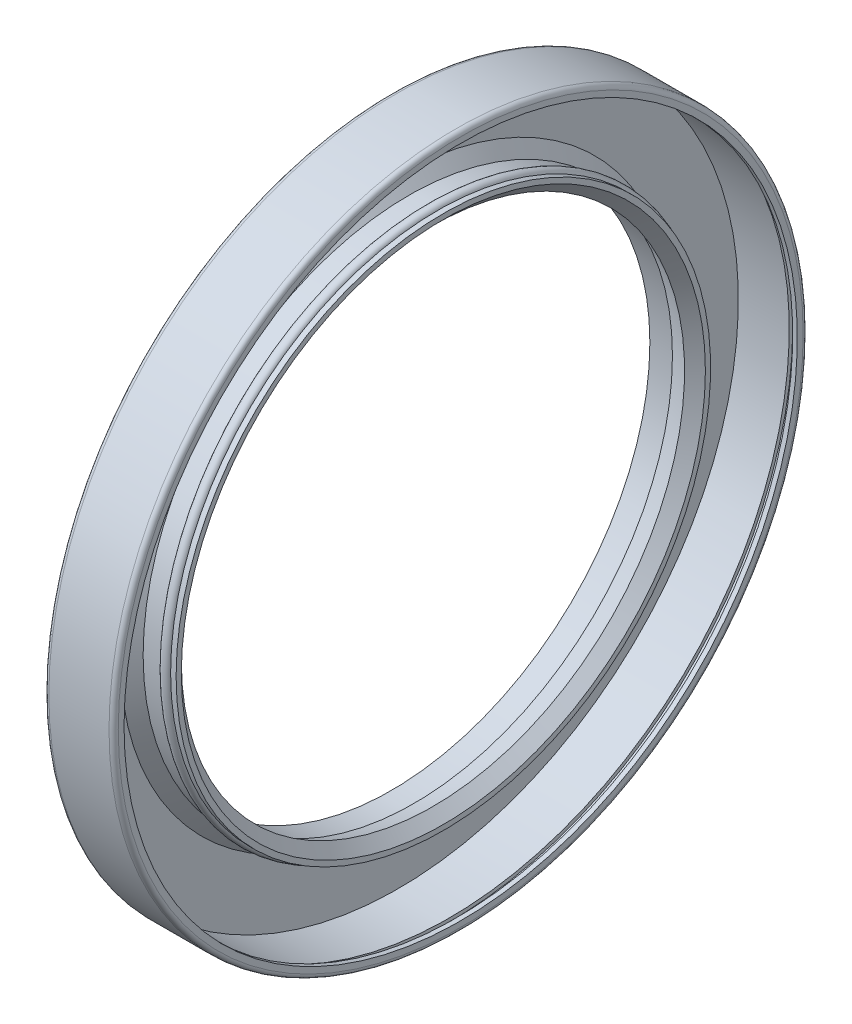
ISO-10303-21;
HEADER;
FILE_DESCRIPTION(('STEP AP214'),'2;1');
FILE_NAME('part.step','',(''),(''),'','','');
FILE_SCHEMA(('AUTOMOTIVE_DESIGN { 1 0 10303 214 1 1 1 1 }'));
ENDSEC;
DATA;
#1=APPLICATION_CONTEXT('core data for automotive mechanical design processes');
#2=APPLICATION_PROTOCOL_DEFINITION('international standard','automotive_design',2000,#1);
#3=PRODUCT_CONTEXT('',#1,'mechanical');
#4=PRODUCT('Part','Part','',(#3));
#5=PRODUCT_RELATED_PRODUCT_CATEGORY('part','',(#4));
#6=PRODUCT_DEFINITION_FORMATION('','',#4);
#7=PRODUCT_DEFINITION_CONTEXT('part definition',#1,'design');
#8=PRODUCT_DEFINITION('design','',#6,#7);
#9=PRODUCT_DEFINITION_SHAPE('','',#8);
#10=(LENGTH_UNIT() NAMED_UNIT(*) SI_UNIT(.MILLI.,.METRE.));
#11=(NAMED_UNIT(*) PLANE_ANGLE_UNIT() SI_UNIT($,.RADIAN.));
#12=(NAMED_UNIT(*) SI_UNIT($,.STERADIAN.) SOLID_ANGLE_UNIT());
#13=UNCERTAINTY_MEASURE_WITH_UNIT(LENGTH_MEASURE(1.E-05),#10,'distance_accuracy_value','');
#14=(GEOMETRIC_REPRESENTATION_CONTEXT(3) GLOBAL_UNCERTAINTY_ASSIGNED_CONTEXT((#13)) GLOBAL_UNIT_ASSIGNED_CONTEXT((#10,
#11,#12)) REPRESENTATION_CONTEXT('',''));
#15=CARTESIAN_POINT('',(0.,0.,0.));
#16=DIRECTION('',(0.,0.,1.));
#17=DIRECTION('',(1.,0.,0.));
#18=AXIS2_PLACEMENT_3D('',#15,#16,#17);
#19=CARTESIAN_POINT('',(0.,0.,-29.8));
#20=DIRECTION('',(1.,0.,0.));
#21=DIRECTION('',(0.,0.,-1.));
#22=AXIS2_PLACEMENT_3D('',#19,#20,#21);
#23=PLANE('',#22);
#24=CARTESIAN_POINT('',(0.,0.,0.));
#25=DIRECTION('',(-1.,0.,0.));
#26=DIRECTION('',(0.,0.,1.));
#27=AXIS2_PLACEMENT_3D('',#24,#25,#26);
#28=CIRCLE('',#27,39.4666666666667);
#29=CARTESIAN_POINT('',(0.,0.,39.4666666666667));
#30=VERTEX_POINT('',#29);
#31=EDGE_CURVE('E69',#30,#30,#28,.T.);
#32=ORIENTED_EDGE('',*,*,#31,.T.);
#33=EDGE_LOOP('',(#32));
#34=FACE_BOUND('',#33,.T.);
#35=CARTESIAN_POINT('',(0.,0.,0.));
#36=DIRECTION('',(1.,0.,0.));
#37=DIRECTION('',(0.,0.,-1.));
#38=AXIS2_PLACEMENT_3D('',#35,#36,#37);
#39=CIRCLE('',#38,30.2);
#40=CARTESIAN_POINT('',(0.,0.,-30.2));
#41=VERTEX_POINT('',#40);
#42=EDGE_CURVE('E10',#41,#41,#39,.F.);
#43=ORIENTED_EDGE('',*,*,#42,.F.);
#44=EDGE_LOOP('',(#43));
#45=FACE_BOUND('',#44,.T.);
#46=ADVANCED_FACE('F31',(#34,#45),#23,.F.);
#47=CARTESIAN_POINT('',(0.,0.,0.));
#48=DIRECTION('',(-1.,0.,0.));
#49=DIRECTION('',(0.,0.,1.));
#50=AXIS2_PLACEMENT_3D('',#47,#48,#49);
#51=CYLINDRICAL_SURFACE('',#50,39.2);
#52=CARTESIAN_POINT('',(6.66666666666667,0.,0.));
#53=DIRECTION('',(-1.,0.,0.));
#54=DIRECTION('',(0.,0.,1.));
#55=AXIS2_PLACEMENT_3D('',#52,#53,#54);
#56=CIRCLE('',#55,39.2);
#57=CARTESIAN_POINT('',(6.66666666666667,0.,39.2));
#58=VERTEX_POINT('',#57);
#59=EDGE_CURVE('E39',#58,#58,#56,.T.);
#60=ORIENTED_EDGE('',*,*,#59,.F.);
#61=EDGE_LOOP('',(#60));
#62=FACE_BOUND('',#61,.T.);
#63=CARTESIAN_POINT('',(0.8,0.,0.));
#64=DIRECTION('',(-1.,0.,0.));
#65=DIRECTION('',(0.,0.,1.));
#66=AXIS2_PLACEMENT_3D('',#63,#64,#65);
#67=CIRCLE('',#66,39.2);
#68=CARTESIAN_POINT('',(0.8,0.,39.2));
#69=VERTEX_POINT('',#68);
#70=EDGE_CURVE('E99',#69,#69,#67,.T.);
#71=ORIENTED_EDGE('',*,*,#70,.T.);
#72=EDGE_LOOP('',(#71));
#73=FACE_BOUND('',#72,.T.);
#74=ADVANCED_FACE('F33',(#62,#73),#51,.F.);
#75=CARTESIAN_POINT('',(6.66666666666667,0.,-39.2));
#76=DIRECTION('',(-1.,0.,0.));
#77=DIRECTION('',(0.,0.,1.));
#78=AXIS2_PLACEMENT_3D('',#75,#76,#77);
#79=PLANE('',#78);
#80=CARTESIAN_POINT('',(6.66666666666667,0.,0.));
#81=DIRECTION('',(-1.,0.,0.));
#82=DIRECTION('',(0.,0.,1.));
#83=AXIS2_PLACEMENT_3D('',#80,#81,#82);
#84=CIRCLE('',#83,39.6);
#85=CARTESIAN_POINT('',(6.66666666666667,0.,39.6));
#86=VERTEX_POINT('',#85);
#87=EDGE_CURVE('E45',#86,#86,#84,.T.);
#88=ORIENTED_EDGE('',*,*,#87,.F.);
#89=EDGE_LOOP('',(#88));
#90=FACE_BOUND('',#89,.T.);
#91=ORIENTED_EDGE('',*,*,#59,.T.);
#92=EDGE_LOOP('',(#91));
#93=FACE_BOUND('',#92,.T.);
#94=ADVANCED_FACE('F173',(#90,#93),#79,.F.);
#95=CARTESIAN_POINT('',(0.,0.,0.));
#96=DIRECTION('',(-1.,0.,0.));
#97=DIRECTION('',(0.,0.,1.));
#98=AXIS2_PLACEMENT_3D('',#95,#96,#97);
#99=CYLINDRICAL_SURFACE('',#98,39.6);
#100=CARTESIAN_POINT('',(7.46666666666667,0.,0.));
#101=DIRECTION('',(-1.,0.,0.));
#102=DIRECTION('',(0.,0.,1.));
#103=AXIS2_PLACEMENT_3D('',#100,#101,#102);
#104=CIRCLE('',#103,39.6);
#105=CARTESIAN_POINT('',(7.46666666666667,0.,39.6));
#106=VERTEX_POINT('',#105);
#107=EDGE_CURVE('E49',#106,#106,#104,.T.);
#108=ORIENTED_EDGE('',*,*,#107,.F.);
#109=EDGE_LOOP('',(#108));
#110=FACE_BOUND('',#109,.T.);
#111=ORIENTED_EDGE('',*,*,#87,.T.);
#112=EDGE_LOOP('',(#111));
#113=FACE_BOUND('',#112,.T.);
#114=ADVANCED_FACE('F206',(#110,#113),#99,.F.);
#115=CARTESIAN_POINT('',(7.46666666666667,0.,-39.6));
#116=DIRECTION('',(1.,0.,0.));
#117=DIRECTION('',(0.,0.,-1.));
#118=AXIS2_PLACEMENT_3D('',#115,#116,#117);
#119=PLANE('',#118);
#120=CARTESIAN_POINT('',(7.46666666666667,0.,0.));
#121=DIRECTION('',(-1.,0.,0.));
#122=DIRECTION('',(0.,0.,1.));
#123=AXIS2_PLACEMENT_3D('',#120,#121,#122);
#124=CIRCLE('',#123,38.8);
#125=CARTESIAN_POINT('',(7.46666666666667,0.,38.8));
#126=VERTEX_POINT('',#125);
#127=EDGE_CURVE('E54',#126,#126,#124,.T.);
#128=ORIENTED_EDGE('',*,*,#127,.F.);
#129=EDGE_LOOP('',(#128));
#130=FACE_BOUND('',#129,.T.);
#131=ORIENTED_EDGE('',*,*,#107,.T.);
#132=EDGE_LOOP('',(#131));
#133=FACE_BOUND('',#132,.T.);
#134=ADVANCED_FACE('F200',(#130,#133),#119,.F.);
#135=CARTESIAN_POINT('',(0.,0.,0.));
#136=DIRECTION('',(-1.,0.,0.));
#137=DIRECTION('',(0.,0.,1.));
#138=AXIS2_PLACEMENT_3D('',#135,#136,#137);
#139=CYLINDRICAL_SURFACE('',#138,38.8);
#140=CARTESIAN_POINT('',(8.,0.,0.));
#141=DIRECTION('',(-1.,0.,0.));
#142=DIRECTION('',(0.,0.,1.));
#143=AXIS2_PLACEMENT_3D('',#140,#141,#142);
#144=CIRCLE('',#143,38.8);
#145=CARTESIAN_POINT('',(8.,0.,38.8));
#146=VERTEX_POINT('',#145);
#147=EDGE_CURVE('E57',#146,#146,#144,.T.);
#148=ORIENTED_EDGE('',*,*,#147,.F.);
#149=EDGE_LOOP('',(#148));
#150=FACE_BOUND('',#149,.T.);
#151=ORIENTED_EDGE('',*,*,#127,.T.);
#152=EDGE_LOOP('',(#151));
#153=FACE_BOUND('',#152,.T.);
#154=ADVANCED_FACE('F194',(#150,#153),#139,.F.);
#155=CARTESIAN_POINT('',(8.,0.,-38.8));
#156=DIRECTION('',(-1.,0.,0.));
#157=DIRECTION('',(0.,0.,1.));
#158=AXIS2_PLACEMENT_3D('',#155,#156,#157);
#159=PLANE('',#158);
#160=CARTESIAN_POINT('',(8.,0.,0.));
#161=DIRECTION('',(-1.,0.,0.));
#162=DIRECTION('',(0.,0.,1.));
#163=AXIS2_PLACEMENT_3D('',#160,#161,#162);
#164=CIRCLE('',#163,39.4666666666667);
#165=CARTESIAN_POINT('',(8.,0.,39.4666666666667));
#166=VERTEX_POINT('',#165);
#167=EDGE_CURVE('E60',#166,#166,#164,.T.);
#168=ORIENTED_EDGE('',*,*,#167,.F.);
#169=EDGE_LOOP('',(#168));
#170=FACE_BOUND('',#169,.T.);
#171=ORIENTED_EDGE('',*,*,#147,.T.);
#172=EDGE_LOOP('',(#171));
#173=FACE_BOUND('',#172,.T.);
#174=ADVANCED_FACE('F188',(#170,#173),#159,.F.);
#175=CARTESIAN_POINT('',(7.46666666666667,0.,0.));
#176=DIRECTION('',(-1.,0.,0.));
#177=DIRECTION('',(0.,0.,1.));
#178=AXIS2_PLACEMENT_3D('',#175,#176,#177);
#179=TOROIDAL_SURFACE('',#178,39.4666666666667,0.533333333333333);
#180=CARTESIAN_POINT('',(7.46666666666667,0.,0.));
#181=DIRECTION('',(-1.,0.,0.));
#182=DIRECTION('',(0.,0.,1.));
#183=AXIS2_PLACEMENT_3D('',#180,#181,#182);
#184=CIRCLE('',#183,40.);
#185=CARTESIAN_POINT('',(7.46666666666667,0.,40.));
#186=VERTEX_POINT('',#185);
#187=EDGE_CURVE('E63',#186,#186,#184,.T.);
#188=ORIENTED_EDGE('',*,*,#187,.F.);
#189=EDGE_LOOP('',(#188));
#190=FACE_BOUND('',#189,.T.);
#191=ORIENTED_EDGE('',*,*,#167,.T.);
#192=EDGE_LOOP('',(#191));
#193=FACE_BOUND('',#192,.T.);
#194=ADVANCED_FACE('F182',(#190,#193),#179,.T.);
#195=CARTESIAN_POINT('',(0.,0.,0.));
#196=DIRECTION('',(-1.,0.,0.));
#197=DIRECTION('',(0.,0.,1.));
#198=AXIS2_PLACEMENT_3D('',#195,#196,#197);
#199=CYLINDRICAL_SURFACE('',#198,40.);
#200=CARTESIAN_POINT('',(0.533333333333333,0.,0.));
#201=DIRECTION('',(-1.,0.,0.));
#202=DIRECTION('',(0.,0.,1.));
#203=AXIS2_PLACEMENT_3D('',#200,#201,#202);
#204=CIRCLE('',#203,40.);
#205=CARTESIAN_POINT('',(0.533333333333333,0.,40.));
#206=VERTEX_POINT('',#205);
#207=EDGE_CURVE('E66',#206,#206,#204,.T.);
#208=ORIENTED_EDGE('',*,*,#207,.F.);
#209=EDGE_LOOP('',(#208));
#210=FACE_BOUND('',#209,.T.);
#211=ORIENTED_EDGE('',*,*,#187,.T.);
#212=EDGE_LOOP('',(#211));
#213=FACE_BOUND('',#212,.T.);
#214=ADVANCED_FACE('F165',(#210,#213),#199,.T.);
#215=CARTESIAN_POINT('',(0.533333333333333,0.,0.));
#216=DIRECTION('',(-1.,0.,0.));
#217=DIRECTION('',(0.,0.,1.));
#218=AXIS2_PLACEMENT_3D('',#215,#216,#217);
#219=TOROIDAL_SURFACE('',#218,39.4666666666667,0.533333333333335);
#220=ORIENTED_EDGE('',*,*,#31,.F.);
#221=EDGE_LOOP('',(#220));
#222=FACE_BOUND('',#221,.T.);
#223=ORIENTED_EDGE('',*,*,#207,.T.);
#224=EDGE_LOOP('',(#223));
#225=FACE_BOUND('',#224,.T.);
#226=ADVANCED_FACE('F160',(#222,#225),#219,.T.);
#227=ORIENTED_EDGE('',*,*,#42,.T.);
#228=EDGE_LOOP('',(#227));
#229=FACE_BOUND('',#228,.T.);
#230=CARTESIAN_POINT('',(0.,0.,0.));
#231=DIRECTION('',(-1.,0.,0.));
#232=DIRECTION('',(0.,0.,1.));
#233=AXIS2_PLACEMENT_3D('',#230,#231,#232);
#234=CIRCLE('',#233,29.8);
#235=CARTESIAN_POINT('',(0.,0.,29.8));
#236=VERTEX_POINT('',#235);
#237=EDGE_CURVE('E72',#236,#236,#234,.T.);
#238=ORIENTED_EDGE('',*,*,#237,.F.);
#239=EDGE_LOOP('',(#238));
#240=FACE_BOUND('',#239,.T.);
#241=ADVANCED_FACE('F155',(#229,#240),#23,.F.);
#242=CARTESIAN_POINT('',(0.,0.,0.));
#243=DIRECTION('',(-1.,0.,0.));
#244=DIRECTION('',(0.,0.,1.));
#245=AXIS2_PLACEMENT_3D('',#242,#243,#244);
#246=CYLINDRICAL_SURFACE('',#245,29.8);
#247=CARTESIAN_POINT('',(2.60201806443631,0.,0.));
#248=DIRECTION('',(-1.,0.,0.));
#249=DIRECTION('',(0.,0.,1.));
#250=AXIS2_PLACEMENT_3D('',#247,#248,#249);
#251=CIRCLE('',#250,29.8);
#252=CARTESIAN_POINT('',(2.60201806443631,0.,29.8));
#253=VERTEX_POINT('',#252);
#254=EDGE_CURVE('E75',#253,#253,#251,.T.);
#255=ORIENTED_EDGE('',*,*,#254,.F.);
#256=EDGE_LOOP('',(#255));
#257=FACE_BOUND('',#256,.T.);
#258=ORIENTED_EDGE('',*,*,#237,.T.);
#259=EDGE_LOOP('',(#258));
#260=FACE_BOUND('',#259,.T.);
#261=ADVANCED_FACE('F149',(#257,#260),#246,.F.);
#262=CARTESIAN_POINT('',(2.60201806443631,0.,0.));
#263=DIRECTION('',(-1.,0.,0.));
#264=DIRECTION('',(0.,0.,1.));
#265=AXIS2_PLACEMENT_3D('',#262,#263,#264);
#266=CONICAL_SURFACE('',#265,29.8,0.349065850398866);
#267=CARTESIAN_POINT('',(4.8,0.,0.));
#268=DIRECTION('',(-1.,0.,0.));
#269=DIRECTION('',(0.,0.,1.));
#270=AXIS2_PLACEMENT_3D('',#267,#268,#269);
#271=CIRCLE('',#270,29.);
#272=CARTESIAN_POINT('',(4.8,0.,29.));
#273=VERTEX_POINT('',#272);
#274=EDGE_CURVE('E78',#273,#273,#271,.T.);
#275=ORIENTED_EDGE('',*,*,#274,.F.);
#276=EDGE_LOOP('',(#275));
#277=FACE_BOUND('',#276,.T.);
#278=ORIENTED_EDGE('',*,*,#254,.T.);
#279=EDGE_LOOP('',(#278));
#280=FACE_BOUND('',#279,.T.);
#281=ADVANCED_FACE('F143',(#277,#280),#266,.F.);
#282=CARTESIAN_POINT('',(4.8,0.,0.));
#283=DIRECTION('',(1.,0.,0.));
#284=DIRECTION('',(0.,0.,-1.));
#285=AXIS2_PLACEMENT_3D('',#282,#283,#284);
#286=CONICAL_SURFACE('',#285,29.,0.785398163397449);
#287=CARTESIAN_POINT('',(6.,0.,0.));
#288=DIRECTION('',(-1.,0.,0.));
#289=DIRECTION('',(0.,0.,1.));
#290=AXIS2_PLACEMENT_3D('',#287,#288,#289);
#291=CIRCLE('',#290,30.2);
#292=CARTESIAN_POINT('',(6.,0.,30.2));
#293=VERTEX_POINT('',#292);
#294=EDGE_CURVE('E81',#293,#293,#291,.T.);
#295=ORIENTED_EDGE('',*,*,#294,.F.);
#296=EDGE_LOOP('',(#295));
#297=FACE_BOUND('',#296,.T.);
#298=ORIENTED_EDGE('',*,*,#274,.T.);
#299=EDGE_LOOP('',(#298));
#300=FACE_BOUND('',#299,.T.);
#301=ADVANCED_FACE('F137',(#297,#300),#286,.F.);
#302=CARTESIAN_POINT('',(6.,0.,-30.2));
#303=DIRECTION('',(-1.,0.,0.));
#304=DIRECTION('',(0.,0.,1.));
#305=AXIS2_PLACEMENT_3D('',#302,#303,#304);
#306=PLANE('',#305);
#307=CARTESIAN_POINT('',(6.,0.,0.));
#308=DIRECTION('',(-1.,0.,0.));
#309=DIRECTION('',(0.,0.,1.));
#310=AXIS2_PLACEMENT_3D('',#307,#308,#309);
#311=CIRCLE('',#310,30.8);
#312=CARTESIAN_POINT('',(6.,0.,30.8));
#313=VERTEX_POINT('',#312);
#314=EDGE_CURVE('E84',#313,#313,#311,.T.);
#315=ORIENTED_EDGE('',*,*,#314,.F.);
#316=EDGE_LOOP('',(#315));
#317=FACE_BOUND('',#316,.T.);
#318=ORIENTED_EDGE('',*,*,#294,.T.);
#319=EDGE_LOOP('',(#318));
#320=FACE_BOUND('',#319,.T.);
#321=ADVANCED_FACE('F131',(#317,#320),#306,.F.);
#322=CARTESIAN_POINT('',(0.,0.,0.));
#323=DIRECTION('',(-1.,0.,0.));
#324=DIRECTION('',(0.,0.,1.));
#325=AXIS2_PLACEMENT_3D('',#322,#323,#324);
#326=CYLINDRICAL_SURFACE('',#325,30.8);
#327=CARTESIAN_POINT('',(5.36568542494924,0.,0.));
#328=DIRECTION('',(-1.,0.,0.));
#329=DIRECTION('',(0.,0.,1.));
#330=AXIS2_PLACEMENT_3D('',#327,#328,#329);
#331=CIRCLE('',#330,30.8);
#332=CARTESIAN_POINT('',(5.36568542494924,0.,30.8));
#333=VERTEX_POINT('',#332);
#334=EDGE_CURVE('E87',#333,#333,#331,.T.);
#335=ORIENTED_EDGE('',*,*,#334,.F.);
#336=EDGE_LOOP('',(#335));
#337=FACE_BOUND('',#336,.T.);
#338=ORIENTED_EDGE('',*,*,#314,.T.);
#339=EDGE_LOOP('',(#338));
#340=FACE_BOUND('',#339,.T.);
#341=ADVANCED_FACE('F125',(#337,#340),#326,.T.);
#342=CARTESIAN_POINT('',(4.8,0.,0.));
#343=DIRECTION('',(-1.,0.,0.));
#344=DIRECTION('',(0.,0.,1.));
#345=AXIS2_PLACEMENT_3D('',#342,#343,#344);
#346=TOROIDAL_SURFACE('',#345,30.6,0.6);
#347=CARTESIAN_POINT('',(4.2,0.,0.));
#348=DIRECTION('',(-1.,0.,0.));
#349=DIRECTION('',(0.,0.,1.));
#350=AXIS2_PLACEMENT_3D('',#347,#348,#349);
#351=CIRCLE('',#350,30.6);
#352=CARTESIAN_POINT('',(4.2,0.,30.6));
#353=VERTEX_POINT('',#352);
#354=EDGE_CURVE('E90',#353,#353,#351,.T.);
#355=ORIENTED_EDGE('',*,*,#354,.F.);
#356=EDGE_LOOP('',(#355));
#357=FACE_BOUND('',#356,.T.);
#358=ORIENTED_EDGE('',*,*,#334,.T.);
#359=EDGE_LOOP('',(#358));
#360=FACE_BOUND('',#359,.T.);
#361=ADVANCED_FACE('F119',(#357,#360),#346,.T.);
#362=CARTESIAN_POINT('',(0.,0.,0.));
#363=DIRECTION('',(-1.,0.,0.));
#364=DIRECTION('',(0.,0.,1.));
#365=AXIS2_PLACEMENT_3D('',#362,#363,#364);
#366=CYLINDRICAL_SURFACE('',#365,30.6);
#367=CARTESIAN_POINT('',(2.,0.,0.));
#368=DIRECTION('',(-1.,0.,0.));
#369=DIRECTION('',(0.,0.,1.));
#370=AXIS2_PLACEMENT_3D('',#367,#368,#369);
#371=CIRCLE('',#370,30.6);
#372=CARTESIAN_POINT('',(2.,0.,30.6));
#373=VERTEX_POINT('',#372);
#374=EDGE_CURVE('E93',#373,#373,#371,.T.);
#375=ORIENTED_EDGE('',*,*,#374,.F.);
#376=EDGE_LOOP('',(#375));
#377=FACE_BOUND('',#376,.T.);
#378=ORIENTED_EDGE('',*,*,#354,.T.);
#379=EDGE_LOOP('',(#378));
#380=FACE_BOUND('',#379,.T.);
#381=ADVANCED_FACE('F113',(#377,#380),#366,.T.);
#382=CARTESIAN_POINT('',(2.,0.,0.));
#383=DIRECTION('',(-1.,0.,0.));
#384=DIRECTION('',(0.,0.,1.));
#385=AXIS2_PLACEMENT_3D('',#382,#383,#384);
#386=CONICAL_SURFACE('',#385,30.6,0.872664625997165);
#387=CARTESIAN_POINT('',(0.800000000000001,0.,0.));
#388=DIRECTION('',(-1.,0.,0.));
#389=DIRECTION('',(0.,0.,1.));
#390=AXIS2_PLACEMENT_3D('',#387,#388,#389);
#391=CIRCLE('',#390,32.030104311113);
#392=CARTESIAN_POINT('',(0.800000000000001,0.,32.030104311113));
#393=VERTEX_POINT('',#392);
#394=EDGE_CURVE('E96',#393,#393,#391,.T.);
#395=ORIENTED_EDGE('',*,*,#394,.F.);
#396=EDGE_LOOP('',(#395));
#397=FACE_BOUND('',#396,.T.);
#398=ORIENTED_EDGE('',*,*,#374,.T.);
#399=EDGE_LOOP('',(#398));
#400=FACE_BOUND('',#399,.T.);
#401=ADVANCED_FACE('F107',(#397,#400),#386,.T.);
#402=CARTESIAN_POINT('',(0.8,0.,-39.2));
#403=DIRECTION('',(-1.,0.,0.));
#404=DIRECTION('',(0.,0.,1.));
#405=AXIS2_PLACEMENT_3D('',#402,#403,#404);
#406=PLANE('',#405);
#407=ORIENTED_EDGE('',*,*,#70,.F.);
#408=EDGE_LOOP('',(#407));
#409=FACE_BOUND('',#408,.T.);
#410=ORIENTED_EDGE('',*,*,#394,.T.);
#411=EDGE_LOOP('',(#410));
#412=FACE_BOUND('',#411,.T.);
#413=ADVANCED_FACE('F104',(#409,#412),#406,.F.);
#414=CLOSED_SHELL('',(#46,#74,#94,#114,#134,#154,#174,#194,#214,#226,#241,#261,#281,#301,#321,
#341,#361,#381,#401,#413));
#415=MANIFOLD_SOLID_BREP('B2',#414);
#416=ADVANCED_BREP_SHAPE_REPRESENTATION('',(#18,#415),#14);
#417=SHAPE_DEFINITION_REPRESENTATION(#9,#416);
ENDSEC;
END-ISO-10303-21;
